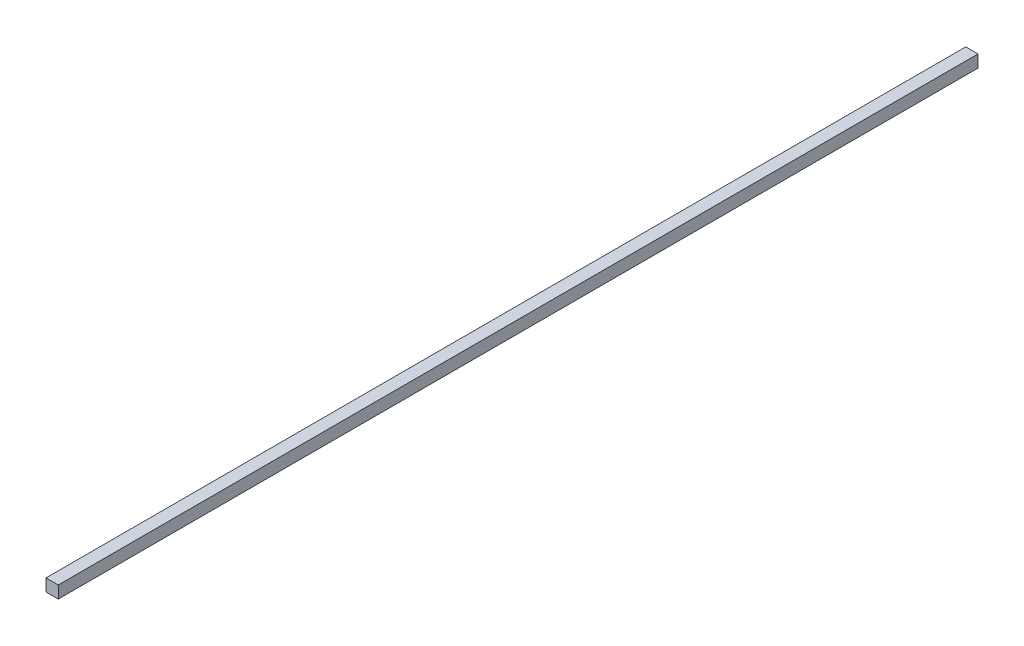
from build123d import *

# Parameters (mm, degrees)
ESQUISSE1_W      = 2
ESQUISSE1_H      = 2
EXTRUSION1_DEPTH = 75


with BuildPart() as part:
    # Esquisse1 → Extrusion1 (new, symmetric)
    with BuildSketch(Plane.XY):
        Rectangle(ESQUISSE1_W, ESQUISSE1_H)
    extrude(amount=EXTRUSION1_DEPTH, both=True)


solid = part.part
